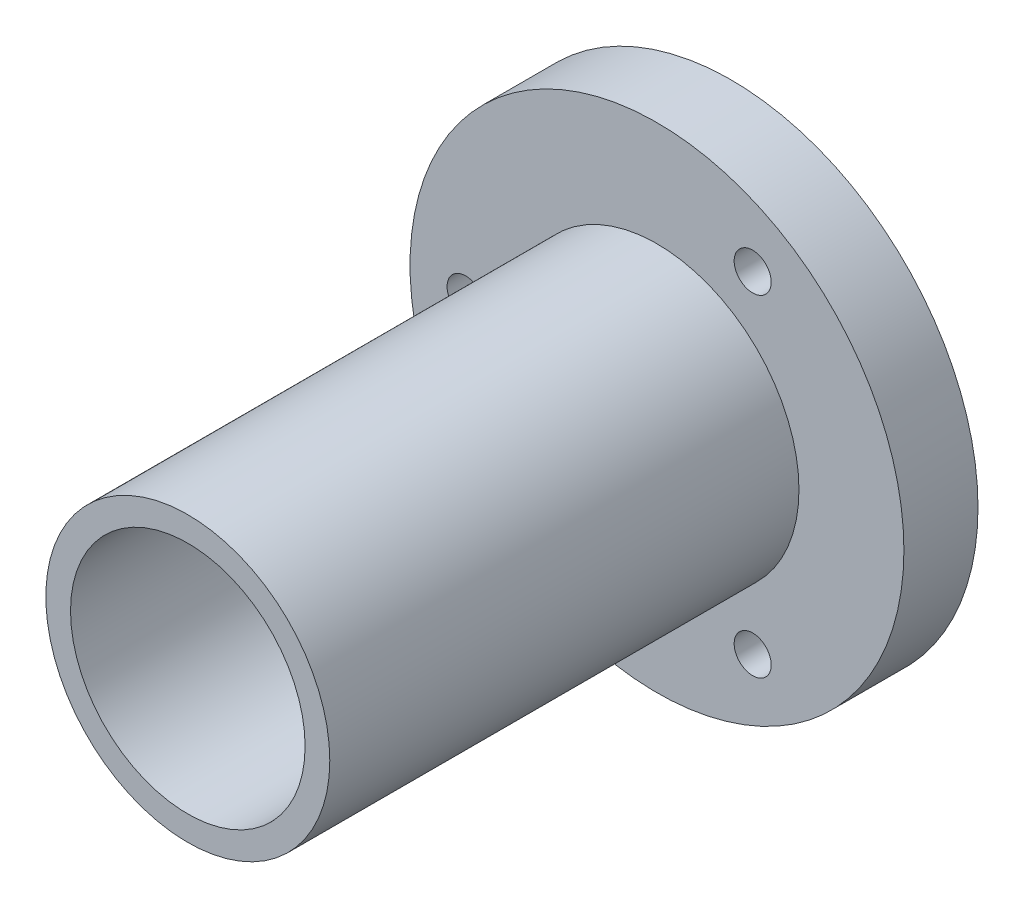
ISO-10303-21;
HEADER;
FILE_DESCRIPTION(('STEP AP214'),'2;1');
FILE_NAME('part.step','',(''),(''),'','','');
FILE_SCHEMA(('AUTOMOTIVE_DESIGN { 1 0 10303 214 1 1 1 1 }'));
ENDSEC;
DATA;
#1=APPLICATION_CONTEXT('core data for automotive mechanical design processes');
#2=APPLICATION_PROTOCOL_DEFINITION('international standard','automotive_design',2000,#1);
#3=PRODUCT_CONTEXT('',#1,'mechanical');
#4=PRODUCT('Part','Part','',(#3));
#5=PRODUCT_RELATED_PRODUCT_CATEGORY('part','',(#4));
#6=PRODUCT_DEFINITION_FORMATION('','',#4);
#7=PRODUCT_DEFINITION_CONTEXT('part definition',#1,'design');
#8=PRODUCT_DEFINITION('design','',#6,#7);
#9=PRODUCT_DEFINITION_SHAPE('','',#8);
#10=(LENGTH_UNIT() NAMED_UNIT(*) SI_UNIT(.MILLI.,.METRE.));
#11=(NAMED_UNIT(*) PLANE_ANGLE_UNIT() SI_UNIT($,.RADIAN.));
#12=(NAMED_UNIT(*) SI_UNIT($,.STERADIAN.) SOLID_ANGLE_UNIT());
#13=UNCERTAINTY_MEASURE_WITH_UNIT(LENGTH_MEASURE(1.E-05),#10,'distance_accuracy_value','');
#14=(GEOMETRIC_REPRESENTATION_CONTEXT(3) GLOBAL_UNCERTAINTY_ASSIGNED_CONTEXT((#13)) GLOBAL_UNIT_ASSIGNED_CONTEXT((#10,
#11,#12)) REPRESENTATION_CONTEXT('',''));
#15=CARTESIAN_POINT('',(0.,0.,0.));
#16=DIRECTION('',(0.,0.,1.));
#17=DIRECTION('',(1.,0.,0.));
#18=AXIS2_PLACEMENT_3D('',#15,#16,#17);
#19=CARTESIAN_POINT('',(0.,0.,6.));
#20=DIRECTION('',(0.,0.,-1.));
#21=DIRECTION('',(-1.,0.,0.));
#22=AXIS2_PLACEMENT_3D('',#19,#20,#21);
#23=CYLINDRICAL_SURFACE('',#22,20.);
#24=CARTESIAN_POINT('',(0.,0.,6.));
#25=DIRECTION('',(0.,0.,1.));
#26=DIRECTION('',(1.,0.,0.));
#27=AXIS2_PLACEMENT_3D('',#24,#25,#26);
#28=CIRCLE('',#27,20.);
#29=CARTESIAN_POINT('',(20.,0.,6.));
#30=VERTEX_POINT('',#29);
#31=EDGE_CURVE('E10',#30,#30,#28,.T.);
#32=ORIENTED_EDGE('',*,*,#31,.F.);
#33=EDGE_LOOP('',(#32));
#34=FACE_BOUND('',#33,.T.);
#35=CARTESIAN_POINT('',(0.,0.,0.));
#36=DIRECTION('',(0.,0.,1.));
#37=DIRECTION('',(1.,0.,0.));
#38=AXIS2_PLACEMENT_3D('',#35,#36,#37);
#39=CIRCLE('',#38,20.);
#40=CARTESIAN_POINT('',(20.,0.,0.));
#41=VERTEX_POINT('',#40);
#42=EDGE_CURVE('E35',#41,#41,#39,.T.);
#43=ORIENTED_EDGE('',*,*,#42,.T.);
#44=EDGE_LOOP('',(#43));
#45=FACE_BOUND('',#44,.T.);
#46=ADVANCED_FACE('F32',(#34,#45),#23,.T.);
#47=CARTESIAN_POINT('',(0.,0.,6.));
#48=DIRECTION('',(0.,0.,1.));
#49=DIRECTION('',(1.,0.,0.));
#50=AXIS2_PLACEMENT_3D('',#47,#48,#49);
#51=PLANE('',#50);
#52=CARTESIAN_POINT('',(7.74999999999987,-13.4233937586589,6.));
#53=DIRECTION('',(0.,0.,1.));
#54=DIRECTION('',(1.,0.,0.));
#55=AXIS2_PLACEMENT_3D('',#52,#53,#54);
#56=CIRCLE('',#55,1.5);
#57=CARTESIAN_POINT('',(9.24999999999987,-13.4233937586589,6.));
#58=VERTEX_POINT('',#57);
#59=EDGE_CURVE('E67',#58,#58,#56,.T.);
#60=ORIENTED_EDGE('',*,*,#59,.F.);
#61=EDGE_LOOP('',(#60));
#62=FACE_BOUND('',#61,.T.);
#63=CARTESIAN_POINT('',(7.75000000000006,13.4233937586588,6.));
#64=DIRECTION('',(0.,0.,1.));
#65=DIRECTION('',(1.,0.,0.));
#66=AXIS2_PLACEMENT_3D('',#63,#64,#65);
#67=CIRCLE('',#66,1.5);
#68=CARTESIAN_POINT('',(9.25000000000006,13.4233937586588,6.));
#69=VERTEX_POINT('',#68);
#70=EDGE_CURVE('E61',#69,#69,#67,.T.);
#71=ORIENTED_EDGE('',*,*,#70,.F.);
#72=EDGE_LOOP('',(#71));
#73=FACE_BOUND('',#72,.T.);
#74=CARTESIAN_POINT('',(-15.5,0.,6.));
#75=DIRECTION('',(0.,0.,1.));
#76=DIRECTION('',(1.,0.,0.));
#77=AXIS2_PLACEMENT_3D('',#74,#75,#76);
#78=CIRCLE('',#77,1.5);
#79=CARTESIAN_POINT('',(-14.,0.,6.));
#80=VERTEX_POINT('',#79);
#81=EDGE_CURVE('E55',#80,#80,#78,.T.);
#82=ORIENTED_EDGE('',*,*,#81,.F.);
#83=EDGE_LOOP('',(#82));
#84=FACE_BOUND('',#83,.T.);
#85=CARTESIAN_POINT('',(0.,0.,6.));
#86=DIRECTION('',(0.,0.,1.));
#87=DIRECTION('',(1.,0.,0.));
#88=AXIS2_PLACEMENT_3D('',#85,#86,#87);
#89=CIRCLE('',#88,11.5);
#90=CARTESIAN_POINT('',(11.5,0.,6.));
#91=VERTEX_POINT('',#90);
#92=EDGE_CURVE('E44',#91,#91,#89,.T.);
#93=ORIENTED_EDGE('',*,*,#92,.F.);
#94=EDGE_LOOP('',(#93));
#95=FACE_BOUND('',#94,.T.);
#96=ORIENTED_EDGE('',*,*,#31,.T.);
#97=EDGE_LOOP('',(#96));
#98=FACE_BOUND('',#97,.T.);
#99=ADVANCED_FACE('F81',(#62,#73,#84,#95,#98),#51,.T.);
#100=CARTESIAN_POINT('',(0.,0.,0.));
#101=DIRECTION('',(0.,0.,1.));
#102=DIRECTION('',(1.,0.,0.));
#103=AXIS2_PLACEMENT_3D('',#100,#101,#102);
#104=PLANE('',#103);
#105=CARTESIAN_POINT('',(7.74999999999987,-13.4233937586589,0.));
#106=DIRECTION('',(0.,0.,-1.));
#107=DIRECTION('',(-1.,0.,0.));
#108=AXIS2_PLACEMENT_3D('',#105,#106,#107);
#109=CIRCLE('',#108,1.49999999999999);
#110=CARTESIAN_POINT('',(6.24999999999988,-13.4233937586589,0.));
#111=VERTEX_POINT('',#110);
#112=EDGE_CURVE('E70',#111,#111,#109,.T.);
#113=ORIENTED_EDGE('',*,*,#112,.F.);
#114=EDGE_LOOP('',(#113));
#115=FACE_BOUND('',#114,.T.);
#116=CARTESIAN_POINT('',(7.75000000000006,13.4233937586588,0.));
#117=DIRECTION('',(0.,0.,-1.));
#118=DIRECTION('',(-1.,0.,0.));
#119=AXIS2_PLACEMENT_3D('',#116,#117,#118);
#120=CIRCLE('',#119,1.49999999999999);
#121=CARTESIAN_POINT('',(6.25000000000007,13.4233937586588,0.));
#122=VERTEX_POINT('',#121);
#123=EDGE_CURVE('E64',#122,#122,#120,.T.);
#124=ORIENTED_EDGE('',*,*,#123,.F.);
#125=EDGE_LOOP('',(#124));
#126=FACE_BOUND('',#125,.T.);
#127=CARTESIAN_POINT('',(-15.5,0.,0.));
#128=DIRECTION('',(0.,0.,-1.));
#129=DIRECTION('',(-1.,0.,0.));
#130=AXIS2_PLACEMENT_3D('',#127,#128,#129);
#131=CIRCLE('',#130,1.49999999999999);
#132=CARTESIAN_POINT('',(-17.,0.,0.));
#133=VERTEX_POINT('',#132);
#134=EDGE_CURVE('E58',#133,#133,#131,.T.);
#135=ORIENTED_EDGE('',*,*,#134,.F.);
#136=EDGE_LOOP('',(#135));
#137=FACE_BOUND('',#136,.T.);
#138=CARTESIAN_POINT('',(0.,0.,0.));
#139=DIRECTION('',(0.,0.,-1.));
#140=DIRECTION('',(-1.,0.,0.));
#141=AXIS2_PLACEMENT_3D('',#138,#139,#140);
#142=CIRCLE('',#141,9.49999999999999);
#143=CARTESIAN_POINT('',(-9.49999999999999,0.,0.));
#144=VERTEX_POINT('',#143);
#145=EDGE_CURVE('E52',#144,#144,#142,.T.);
#146=ORIENTED_EDGE('',*,*,#145,.F.);
#147=EDGE_LOOP('',(#146));
#148=FACE_BOUND('',#147,.T.);
#149=ORIENTED_EDGE('',*,*,#42,.F.);
#150=EDGE_LOOP('',(#149));
#151=FACE_BOUND('',#150,.T.);
#152=ADVANCED_FACE('F77',(#115,#126,#137,#148,#151),#104,.F.);
#153=CARTESIAN_POINT('',(0.,0.,44.));
#154=DIRECTION('',(0.,0.,-1.));
#155=DIRECTION('',(-1.,0.,0.));
#156=AXIS2_PLACEMENT_3D('',#153,#154,#155);
#157=CYLINDRICAL_SURFACE('',#156,11.5);
#158=CARTESIAN_POINT('',(0.,0.,44.));
#159=DIRECTION('',(0.,0.,1.));
#160=DIRECTION('',(1.,0.,0.));
#161=AXIS2_PLACEMENT_3D('',#158,#159,#160);
#162=CIRCLE('',#161,11.5);
#163=CARTESIAN_POINT('',(11.5,0.,44.));
#164=VERTEX_POINT('',#163);
#165=EDGE_CURVE('E42',#164,#164,#162,.T.);
#166=ORIENTED_EDGE('',*,*,#165,.F.);
#167=EDGE_LOOP('',(#166));
#168=FACE_BOUND('',#167,.T.);
#169=ORIENTED_EDGE('',*,*,#92,.T.);
#170=EDGE_LOOP('',(#169));
#171=FACE_BOUND('',#170,.T.);
#172=ADVANCED_FACE('F80',(#168,#171),#157,.T.);
#173=CARTESIAN_POINT('',(0.,0.,44.));
#174=DIRECTION('',(0.,0.,1.));
#175=DIRECTION('',(1.,0.,0.));
#176=AXIS2_PLACEMENT_3D('',#173,#174,#175);
#177=PLANE('',#176);
#178=CARTESIAN_POINT('',(0.,0.,44.));
#179=DIRECTION('',(0.,0.,1.));
#180=DIRECTION('',(1.,0.,0.));
#181=AXIS2_PLACEMENT_3D('',#178,#179,#180);
#182=CIRCLE('',#181,9.49999999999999);
#183=CARTESIAN_POINT('',(9.49999999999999,0.,44.));
#184=VERTEX_POINT('',#183);
#185=EDGE_CURVE('E47',#184,#184,#182,.T.);
#186=ORIENTED_EDGE('',*,*,#185,.F.);
#187=EDGE_LOOP('',(#186));
#188=FACE_BOUND('',#187,.T.);
#189=ORIENTED_EDGE('',*,*,#165,.T.);
#190=EDGE_LOOP('',(#189));
#191=FACE_BOUND('',#190,.T.);
#192=ADVANCED_FACE('F104',(#188,#191),#177,.T.);
#193=CARTESIAN_POINT('',(0.,0.,0.));
#194=DIRECTION('',(0.,0.,-1.));
#195=DIRECTION('',(-1.,0.,0.));
#196=AXIS2_PLACEMENT_3D('',#193,#194,#195);
#197=CYLINDRICAL_SURFACE('',#196,9.49999999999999);
#198=ORIENTED_EDGE('',*,*,#145,.T.);
#199=EDGE_LOOP('',(#198));
#200=FACE_BOUND('',#199,.T.);
#201=ORIENTED_EDGE('',*,*,#185,.T.);
#202=EDGE_LOOP('',(#201));
#203=FACE_BOUND('',#202,.T.);
#204=ADVANCED_FACE('F108',(#200,#203),#197,.F.);
#205=CARTESIAN_POINT('',(-15.5,0.,0.));
#206=DIRECTION('',(0.,0.,-1.));
#207=DIRECTION('',(-1.,0.,0.));
#208=AXIS2_PLACEMENT_3D('',#205,#206,#207);
#209=CYLINDRICAL_SURFACE('',#208,1.5);
#210=ORIENTED_EDGE('',*,*,#134,.T.);
#211=EDGE_LOOP('',(#210));
#212=FACE_BOUND('',#211,.T.);
#213=ORIENTED_EDGE('',*,*,#81,.T.);
#214=EDGE_LOOP('',(#213));
#215=FACE_BOUND('',#214,.T.);
#216=ADVANCED_FACE('F112',(#212,#215),#209,.F.);
#217=CARTESIAN_POINT('',(7.75000000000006,13.4233937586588,0.));
#218=DIRECTION('',(0.,0.,-1.));
#219=DIRECTION('',(-1.,0.,0.));
#220=AXIS2_PLACEMENT_3D('',#217,#218,#219);
#221=CYLINDRICAL_SURFACE('',#220,1.5);
#222=ORIENTED_EDGE('',*,*,#123,.T.);
#223=EDGE_LOOP('',(#222));
#224=FACE_BOUND('',#223,.T.);
#225=ORIENTED_EDGE('',*,*,#70,.T.);
#226=EDGE_LOOP('',(#225));
#227=FACE_BOUND('',#226,.T.);
#228=ADVANCED_FACE('F116',(#224,#227),#221,.F.);
#229=CARTESIAN_POINT('',(7.74999999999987,-13.4233937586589,0.));
#230=DIRECTION('',(0.,0.,-1.));
#231=DIRECTION('',(-1.,0.,0.));
#232=AXIS2_PLACEMENT_3D('',#229,#230,#231);
#233=CYLINDRICAL_SURFACE('',#232,1.5);
#234=ORIENTED_EDGE('',*,*,#112,.T.);
#235=EDGE_LOOP('',(#234));
#236=FACE_BOUND('',#235,.T.);
#237=ORIENTED_EDGE('',*,*,#59,.T.);
#238=EDGE_LOOP('',(#237));
#239=FACE_BOUND('',#238,.T.);
#240=ADVANCED_FACE('F74',(#236,#239),#233,.F.);
#241=CLOSED_SHELL('',(#46,#99,#152,#172,#192,#204,#216,#228,#240));
#242=MANIFOLD_SOLID_BREP('B2',#241);
#243=ADVANCED_BREP_SHAPE_REPRESENTATION('',(#18,#242),#14);
#244=SHAPE_DEFINITION_REPRESENTATION(#9,#243);
ENDSEC;
END-ISO-10303-21;
